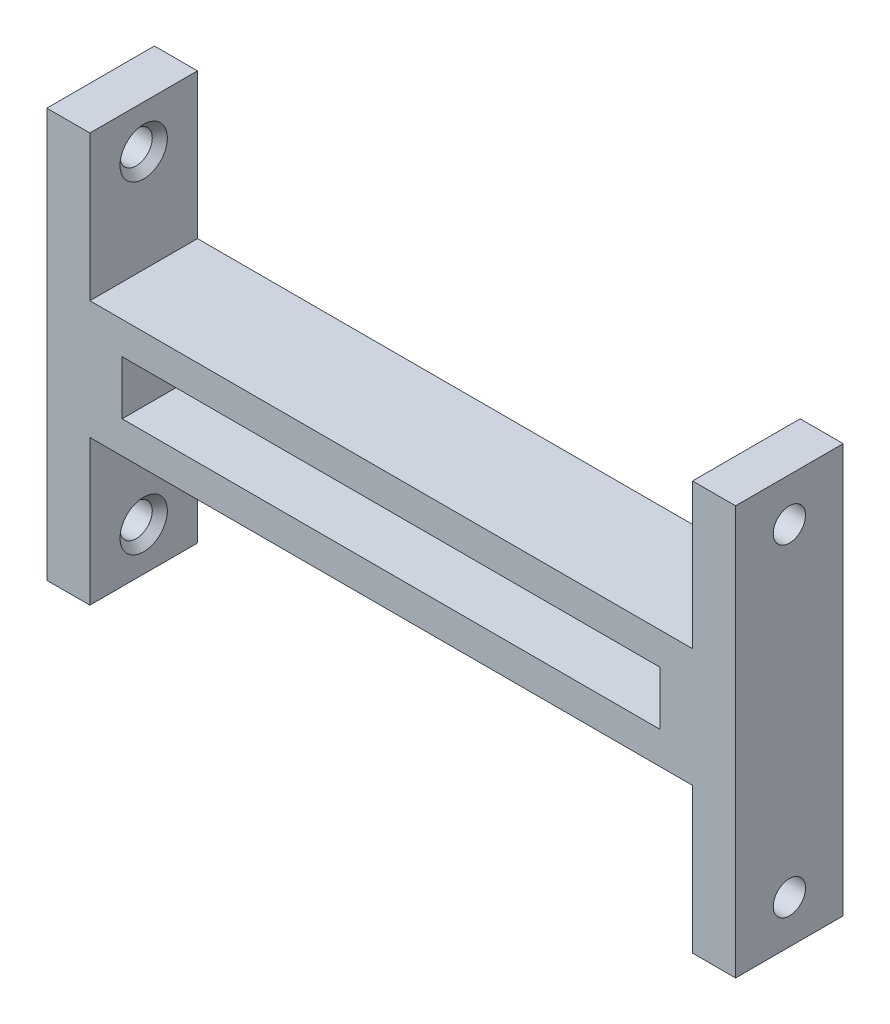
ISO-10303-21;
HEADER;
FILE_DESCRIPTION(('STEP AP214'),'2;1');
FILE_NAME('part.step','',(''),(''),'','','');
FILE_SCHEMA(('AUTOMOTIVE_DESIGN { 1 0 10303 214 1 1 1 1 }'));
ENDSEC;
DATA;
#1=APPLICATION_CONTEXT('core data for automotive mechanical design processes');
#2=APPLICATION_PROTOCOL_DEFINITION('international standard','automotive_design',2000,#1);
#3=PRODUCT_CONTEXT('',#1,'mechanical');
#4=PRODUCT('Part','Part','',(#3));
#5=PRODUCT_RELATED_PRODUCT_CATEGORY('part','',(#4));
#6=PRODUCT_DEFINITION_FORMATION('','',#4);
#7=PRODUCT_DEFINITION_CONTEXT('part definition',#1,'design');
#8=PRODUCT_DEFINITION('design','',#6,#7);
#9=PRODUCT_DEFINITION_SHAPE('','',#8);
#10=(LENGTH_UNIT() NAMED_UNIT(*) SI_UNIT(.MILLI.,.METRE.));
#11=(NAMED_UNIT(*) PLANE_ANGLE_UNIT() SI_UNIT($,.RADIAN.));
#12=(NAMED_UNIT(*) SI_UNIT($,.STERADIAN.) SOLID_ANGLE_UNIT());
#13=UNCERTAINTY_MEASURE_WITH_UNIT(LENGTH_MEASURE(1.E-05),#10,'distance_accuracy_value','');
#14=(GEOMETRIC_REPRESENTATION_CONTEXT(3) GLOBAL_UNCERTAINTY_ASSIGNED_CONTEXT((#13)) GLOBAL_UNIT_ASSIGNED_CONTEXT((#10,
#11,#12)) REPRESENTATION_CONTEXT('',''));
#15=CARTESIAN_POINT('',(0.,0.,0.));
#16=DIRECTION('',(0.,0.,1.));
#17=DIRECTION('',(1.,0.,0.));
#18=AXIS2_PLACEMENT_3D('',#15,#16,#17);
#19=CARTESIAN_POINT('',(-4.83020528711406,40.2956916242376,10.));
#20=DIRECTION('',(-1.,0.,0.));
#21=DIRECTION('',(0.,0.,1.));
#22=AXIS2_PLACEMENT_3D('',#19,#20,#21);
#23=PLANE('',#22);
#24=DIRECTION('',(0.,1.,0.));
#25=VECTOR('',#24,1.);
#26=CARTESIAN_POINT('',(-4.83020528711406,40.2956916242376,0.));
#27=LINE('',#26,#25);
#28=CARTESIAN_POINT('',(-4.83020528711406,40.2956916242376,0.));
#29=VERTEX_POINT('',#28);
#30=CARTESIAN_POINT('',(-4.83020528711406,53.7956916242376,0.));
#31=VERTEX_POINT('',#30);
#32=EDGE_CURVE('E266',#29,#31,#27,.T.);
#33=ORIENTED_EDGE('',*,*,#32,.T.);
#34=DIRECTION('',(0.,0.,-1.));
#35=VECTOR('',#34,1.);
#36=CARTESIAN_POINT('',(-4.83020528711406,53.7956916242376,10.));
#37=LINE('',#36,#35);
#38=CARTESIAN_POINT('',(-4.83020528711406,53.7956916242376,10.));
#39=VERTEX_POINT('',#38);
#40=EDGE_CURVE('E309',#39,#31,#37,.T.);
#41=ORIENTED_EDGE('',*,*,#40,.F.);
#42=DIRECTION('',(0.,1.,0.));
#43=VECTOR('',#42,1.);
#44=CARTESIAN_POINT('',(-4.83020528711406,40.2956916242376,10.));
#45=LINE('',#44,#43);
#46=CARTESIAN_POINT('',(-4.83020528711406,40.2956916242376,10.));
#47=VERTEX_POINT('',#46);
#48=EDGE_CURVE('E229',#47,#39,#45,.T.);
#49=ORIENTED_EDGE('',*,*,#48,.F.);
#50=DIRECTION('',(0.,0.,-1.));
#51=VECTOR('',#50,1.);
#52=CARTESIAN_POINT('',(-4.83020528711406,40.2956916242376,10.));
#53=LINE('',#52,#51);
#54=EDGE_CURVE('E313',#47,#29,#53,.T.);
#55=ORIENTED_EDGE('',*,*,#54,.T.);
#56=EDGE_LOOP('',(#33,#41,#49,#55));
#57=FACE_BOUND('',#56,.T.);
#58=CARTESIAN_POINT('',(-4.83020528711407,49.7956916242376,5.));
#59=DIRECTION('',(1.,0.,0.));
#60=DIRECTION('',(0.,0.,-1.));
#61=AXIS2_PLACEMENT_3D('',#58,#59,#60);
#62=CIRCLE('',#61,2.2);
#63=CARTESIAN_POINT('',(-4.83020528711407,49.7956916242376,2.8));
#64=VERTEX_POINT('',#63);
#65=EDGE_CURVE('E445',#64,#64,#62,.T.);
#66=ORIENTED_EDGE('',*,*,#65,.F.);
#67=EDGE_LOOP('',(#66));
#68=FACE_BOUND('',#67,.T.);
#69=ADVANCED_FACE('F45',(#57,#68),#23,.F.);
#70=CARTESIAN_POINT('',(51.1697947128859,40.2956916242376,10.));
#71=DIRECTION('',(1.,0.,0.));
#72=DIRECTION('',(0.,1.,0.));
#73=AXIS2_PLACEMENT_3D('',#70,#71,#72);
#74=PLANE('',#73);
#75=DIRECTION('',(0.,-1.,0.));
#76=VECTOR('',#75,1.);
#77=CARTESIAN_POINT('',(51.1697947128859,40.2956916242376,0.));
#78=LINE('',#77,#76);
#79=CARTESIAN_POINT('',(51.169794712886,53.7956916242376,0.));
#80=VERTEX_POINT('',#79);
#81=CARTESIAN_POINT('',(51.1697947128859,40.2956916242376,0.));
#82=VERTEX_POINT('',#81);
#83=EDGE_CURVE('E260',#80,#82,#78,.T.);
#84=ORIENTED_EDGE('',*,*,#83,.T.);
#85=DIRECTION('',(0.,0.,-1.));
#86=VECTOR('',#85,1.);
#87=CARTESIAN_POINT('',(51.1697947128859,40.2956916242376,10.));
#88=LINE('',#87,#86);
#89=CARTESIAN_POINT('',(51.1697947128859,40.2956916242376,10.));
#90=VERTEX_POINT('',#89);
#91=EDGE_CURVE('E317',#90,#82,#88,.T.);
#92=ORIENTED_EDGE('',*,*,#91,.F.);
#93=DIRECTION('',(0.,-1.,0.));
#94=VECTOR('',#93,1.);
#95=CARTESIAN_POINT('',(51.1697947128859,40.2956916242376,10.));
#96=LINE('',#95,#94);
#97=CARTESIAN_POINT('',(51.169794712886,53.7956916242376,10.));
#98=VERTEX_POINT('',#97);
#99=EDGE_CURVE('E223',#98,#90,#96,.T.);
#100=ORIENTED_EDGE('',*,*,#99,.F.);
#101=DIRECTION('',(0.,0.,-1.));
#102=VECTOR('',#101,1.);
#103=CARTESIAN_POINT('',(51.169794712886,53.7956916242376,10.));
#104=LINE('',#103,#102);
#105=EDGE_CURVE('E321',#98,#80,#104,.T.);
#106=ORIENTED_EDGE('',*,*,#105,.T.);
#107=EDGE_LOOP('',(#84,#92,#100,#106));
#108=FACE_BOUND('',#107,.T.);
#109=CARTESIAN_POINT('',(51.169794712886,49.7956916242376,5.));
#110=DIRECTION('',(-1.,0.,0.));
#111=DIRECTION('',(0.,0.,1.));
#112=AXIS2_PLACEMENT_3D('',#109,#110,#111);
#113=CIRCLE('',#112,2.2);
#114=CARTESIAN_POINT('',(51.169794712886,49.7956916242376,7.2));
#115=VERTEX_POINT('',#114);
#116=EDGE_CURVE('E331',#115,#115,#113,.T.);
#117=ORIENTED_EDGE('',*,*,#116,.F.);
#118=EDGE_LOOP('',(#117));
#119=FACE_BOUND('',#118,.T.);
#120=ADVANCED_FACE('F389',(#108,#119),#74,.F.);
#121=CARTESIAN_POINT('',(0.,0.,10.));
#122=DIRECTION('',(0.,0.,-1.));
#123=DIRECTION('',(-1.,0.,0.));
#124=AXIS2_PLACEMENT_3D('',#121,#122,#123);
#125=PLANE('',#124);
#126=DIRECTION('',(1.,0.,0.));
#127=VECTOR('',#126,1.);
#128=CARTESIAN_POINT('',(55.1697947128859,15.7956916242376,10.));
#129=LINE('',#128,#127);
#130=CARTESIAN_POINT('',(51.169794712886,15.7956916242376,10.));
#131=VERTEX_POINT('',#130);
#132=CARTESIAN_POINT('',(55.1697947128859,15.7956916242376,10.));
#133=VERTEX_POINT('',#132);
#134=EDGE_CURVE('E212',#131,#133,#129,.T.);
#135=ORIENTED_EDGE('',*,*,#134,.T.);
#136=DIRECTION('',(0.,1.,0.));
#137=VECTOR('',#136,1.);
#138=CARTESIAN_POINT('',(55.1697947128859,53.7956916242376,10.));
#139=LINE('',#138,#137);
#140=CARTESIAN_POINT('',(55.1697947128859,53.7956916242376,10.));
#141=VERTEX_POINT('',#140);
#142=EDGE_CURVE('E216',#133,#141,#139,.T.);
#143=ORIENTED_EDGE('',*,*,#142,.T.);
#144=DIRECTION('',(-1.,0.,0.));
#145=VECTOR('',#144,1.);
#146=CARTESIAN_POINT('',(51.169794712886,53.7956916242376,10.));
#147=LINE('',#146,#145);
#148=EDGE_CURVE('E220',#141,#98,#147,.T.);
#149=ORIENTED_EDGE('',*,*,#148,.T.);
#150=ORIENTED_EDGE('',*,*,#99,.T.);
#151=DIRECTION('',(-1.,0.,0.));
#152=VECTOR('',#151,1.);
#153=CARTESIAN_POINT('',(-4.83020528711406,40.2956916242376,10.));
#154=LINE('',#153,#152);
#155=EDGE_CURVE('E226',#90,#47,#154,.T.);
#156=ORIENTED_EDGE('',*,*,#155,.T.);
#157=ORIENTED_EDGE('',*,*,#48,.T.);
#158=DIRECTION('',(-1.,0.,0.));
#159=VECTOR('',#158,1.);
#160=CARTESIAN_POINT('',(-4.83020528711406,53.7956916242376,10.));
#161=LINE('',#160,#159);
#162=CARTESIAN_POINT('',(-8.83020528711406,53.7956916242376,10.));
#163=VERTEX_POINT('',#162);
#164=EDGE_CURVE('E232',#39,#163,#161,.T.);
#165=ORIENTED_EDGE('',*,*,#164,.T.);
#166=DIRECTION('',(0.,-1.,0.));
#167=VECTOR('',#166,1.);
#168=CARTESIAN_POINT('',(-8.83020528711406,53.7956916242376,10.));
#169=LINE('',#168,#167);
#170=CARTESIAN_POINT('',(-8.83020528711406,15.7956916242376,10.));
#171=VERTEX_POINT('',#170);
#172=EDGE_CURVE('E235',#163,#171,#169,.T.);
#173=ORIENTED_EDGE('',*,*,#172,.T.);
#174=DIRECTION('',(1.,0.,0.));
#175=VECTOR('',#174,1.);
#176=CARTESIAN_POINT('',(-8.83020528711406,15.7956916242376,10.));
#177=LINE('',#176,#175);
#178=CARTESIAN_POINT('',(-4.83020528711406,15.7956916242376,10.));
#179=VERTEX_POINT('',#178);
#180=EDGE_CURVE('E238',#171,#179,#177,.T.);
#181=ORIENTED_EDGE('',*,*,#180,.T.);
#182=DIRECTION('',(0.,1.,0.));
#183=VECTOR('',#182,1.);
#184=CARTESIAN_POINT('',(-4.83020528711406,15.7956916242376,10.));
#185=LINE('',#184,#183);
#186=CARTESIAN_POINT('',(-4.83020528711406,29.2956916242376,10.));
#187=VERTEX_POINT('',#186);
#188=EDGE_CURVE('E241',#179,#187,#185,.T.);
#189=ORIENTED_EDGE('',*,*,#188,.T.);
#190=DIRECTION('',(1.,0.,0.));
#191=VECTOR('',#190,1.);
#192=CARTESIAN_POINT('',(-4.83020528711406,29.2956916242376,10.));
#193=LINE('',#192,#191);
#194=CARTESIAN_POINT('',(51.1697947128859,29.2956916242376,10.));
#195=VERTEX_POINT('',#194);
#196=EDGE_CURVE('E244',#187,#195,#193,.T.);
#197=ORIENTED_EDGE('',*,*,#196,.T.);
#198=DIRECTION('',(0.,-1.,0.));
#199=VECTOR('',#198,1.);
#200=CARTESIAN_POINT('',(51.169794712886,15.7956916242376,10.));
#201=LINE('',#200,#199);
#202=EDGE_CURVE('E247',#195,#131,#201,.T.);
#203=ORIENTED_EDGE('',*,*,#202,.T.);
#204=EDGE_LOOP('',(#135,#143,#149,#150,#156,#157,#165,#173,#181,#189,#197,#203));
#205=FACE_BOUND('',#204,.T.);
#206=DIRECTION('',(0.,-1.,0.));
#207=VECTOR('',#206,1.);
#208=CARTESIAN_POINT('',(-1.83020528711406,32.2956916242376,10.));
#209=LINE('',#208,#207);
#210=CARTESIAN_POINT('',(-1.83020528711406,37.2956916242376,10.));
#211=VERTEX_POINT('',#210);
#212=CARTESIAN_POINT('',(-1.83020528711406,32.2956916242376,10.));
#213=VERTEX_POINT('',#212);
#214=EDGE_CURVE('E161',#211,#213,#209,.T.);
#215=ORIENTED_EDGE('',*,*,#214,.F.);
#216=DIRECTION('',(-1.,0.,0.));
#217=VECTOR('',#216,1.);
#218=CARTESIAN_POINT('',(-1.83020528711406,37.2956916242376,10.));
#219=LINE('',#218,#217);
#220=CARTESIAN_POINT('',(48.1697947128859,37.2956916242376,10.));
#221=VERTEX_POINT('',#220);
#222=EDGE_CURVE('E188',#221,#211,#219,.T.);
#223=ORIENTED_EDGE('',*,*,#222,.F.);
#224=DIRECTION('',(0.,1.,0.));
#225=VECTOR('',#224,1.);
#226=CARTESIAN_POINT('',(48.1697947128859,37.2956916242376,10.));
#227=LINE('',#226,#225);
#228=CARTESIAN_POINT('',(48.1697947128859,32.2956916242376,10.));
#229=VERTEX_POINT('',#228);
#230=EDGE_CURVE('E184',#229,#221,#227,.T.);
#231=ORIENTED_EDGE('',*,*,#230,.F.);
#232=DIRECTION('',(1.,0.,0.));
#233=VECTOR('',#232,1.);
#234=CARTESIAN_POINT('',(-1.83020528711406,32.2956916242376,10.));
#235=LINE('',#234,#233);
#236=EDGE_CURVE('E170',#213,#229,#235,.T.);
#237=ORIENTED_EDGE('',*,*,#236,.F.);
#238=EDGE_LOOP('',(#215,#223,#231,#237));
#239=FACE_BOUND('',#238,.T.);
#240=ADVANCED_FACE('F183',(#205,#239),#125,.F.);
#241=CARTESIAN_POINT('',(0.,0.,0.));
#242=DIRECTION('',(0.,0.,-1.));
#243=DIRECTION('',(-1.,0.,0.));
#244=AXIS2_PLACEMENT_3D('',#241,#242,#243);
#245=PLANE('',#244);
#246=DIRECTION('',(1.,0.,0.));
#247=VECTOR('',#246,1.);
#248=CARTESIAN_POINT('',(55.1697947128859,15.7956916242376,0.));
#249=LINE('',#248,#247);
#250=CARTESIAN_POINT('',(51.169794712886,15.7956916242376,0.));
#251=VERTEX_POINT('',#250);
#252=CARTESIAN_POINT('',(55.1697947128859,15.7956916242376,0.));
#253=VERTEX_POINT('',#252);
#254=EDGE_CURVE('E179',#251,#253,#249,.T.);
#255=ORIENTED_EDGE('',*,*,#254,.F.);
#256=DIRECTION('',(0.,-1.,0.));
#257=VECTOR('',#256,1.);
#258=CARTESIAN_POINT('',(51.169794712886,15.7956916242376,0.));
#259=LINE('',#258,#257);
#260=CARTESIAN_POINT('',(51.1697947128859,29.2956916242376,0.));
#261=VERTEX_POINT('',#260);
#262=EDGE_CURVE('E217',#261,#251,#259,.T.);
#263=ORIENTED_EDGE('',*,*,#262,.F.);
#264=DIRECTION('',(1.,0.,0.));
#265=VECTOR('',#264,1.);
#266=CARTESIAN_POINT('',(-4.83020528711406,29.2956916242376,0.));
#267=LINE('',#266,#265);
#268=CARTESIAN_POINT('',(-4.83020528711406,29.2956916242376,0.));
#269=VERTEX_POINT('',#268);
#270=EDGE_CURVE('E281',#269,#261,#267,.T.);
#271=ORIENTED_EDGE('',*,*,#270,.F.);
#272=DIRECTION('',(0.,1.,0.));
#273=VECTOR('',#272,1.);
#274=CARTESIAN_POINT('',(-4.83020528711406,15.7956916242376,0.));
#275=LINE('',#274,#273);
#276=CARTESIAN_POINT('',(-4.83020528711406,15.7956916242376,0.));
#277=VERTEX_POINT('',#276);
#278=EDGE_CURVE('E278',#277,#269,#275,.T.);
#279=ORIENTED_EDGE('',*,*,#278,.F.);
#280=DIRECTION('',(1.,0.,0.));
#281=VECTOR('',#280,1.);
#282=CARTESIAN_POINT('',(-8.83020528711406,15.7956916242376,0.));
#283=LINE('',#282,#281);
#284=CARTESIAN_POINT('',(-8.83020528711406,15.7956916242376,0.));
#285=VERTEX_POINT('',#284);
#286=EDGE_CURVE('E275',#285,#277,#283,.T.);
#287=ORIENTED_EDGE('',*,*,#286,.F.);
#288=DIRECTION('',(0.,-1.,0.));
#289=VECTOR('',#288,1.);
#290=CARTESIAN_POINT('',(-8.83020528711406,53.7956916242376,0.));
#291=LINE('',#290,#289);
#292=CARTESIAN_POINT('',(-8.83020528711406,53.7956916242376,0.));
#293=VERTEX_POINT('',#292);
#294=EDGE_CURVE('E272',#293,#285,#291,.T.);
#295=ORIENTED_EDGE('',*,*,#294,.F.);
#296=DIRECTION('',(-1.,0.,0.));
#297=VECTOR('',#296,1.);
#298=CARTESIAN_POINT('',(-4.83020528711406,53.7956916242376,0.));
#299=LINE('',#298,#297);
#300=EDGE_CURVE('E269',#31,#293,#299,.T.);
#301=ORIENTED_EDGE('',*,*,#300,.F.);
#302=ORIENTED_EDGE('',*,*,#32,.F.);
#303=DIRECTION('',(-1.,0.,0.));
#304=VECTOR('',#303,1.);
#305=CARTESIAN_POINT('',(-4.83020528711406,40.2956916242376,0.));
#306=LINE('',#305,#304);
#307=EDGE_CURVE('E263',#82,#29,#306,.T.);
#308=ORIENTED_EDGE('',*,*,#307,.F.);
#309=ORIENTED_EDGE('',*,*,#83,.F.);
#310=DIRECTION('',(-1.,0.,0.));
#311=VECTOR('',#310,1.);
#312=CARTESIAN_POINT('',(51.169794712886,53.7956916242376,0.));
#313=LINE('',#312,#311);
#314=CARTESIAN_POINT('',(55.1697947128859,53.7956916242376,0.));
#315=VERTEX_POINT('',#314);
#316=EDGE_CURVE('E257',#315,#80,#313,.T.);
#317=ORIENTED_EDGE('',*,*,#316,.F.);
#318=DIRECTION('',(0.,1.,0.));
#319=VECTOR('',#318,1.);
#320=CARTESIAN_POINT('',(55.1697947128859,53.7956916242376,0.));
#321=LINE('',#320,#319);
#322=EDGE_CURVE('E254',#253,#315,#321,.T.);
#323=ORIENTED_EDGE('',*,*,#322,.F.);
#324=EDGE_LOOP('',(#255,#263,#271,#279,#287,#295,#301,#302,#308,#309,#317,#323));
#325=FACE_BOUND('',#324,.T.);
#326=DIRECTION('',(-1.,0.,0.));
#327=VECTOR('',#326,1.);
#328=CARTESIAN_POINT('',(-1.83020528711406,37.2956916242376,0.));
#329=LINE('',#328,#327);
#330=CARTESIAN_POINT('',(48.1697947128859,37.2956916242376,0.));
#331=VERTEX_POINT('',#330);
#332=CARTESIAN_POINT('',(-1.83020528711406,37.2956916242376,0.));
#333=VERTEX_POINT('',#332);
#334=EDGE_CURVE('E171',#331,#333,#329,.T.);
#335=ORIENTED_EDGE('',*,*,#334,.T.);
#336=DIRECTION('',(0.,-1.,0.));
#337=VECTOR('',#336,1.);
#338=CARTESIAN_POINT('',(-1.83020528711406,32.2956916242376,0.));
#339=LINE('',#338,#337);
#340=CARTESIAN_POINT('',(-1.83020528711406,32.2956916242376,0.));
#341=VERTEX_POINT('',#340);
#342=EDGE_CURVE('E71',#333,#341,#339,.T.);
#343=ORIENTED_EDGE('',*,*,#342,.T.);
#344=DIRECTION('',(1.,0.,0.));
#345=VECTOR('',#344,1.);
#346=CARTESIAN_POINT('',(-1.83020528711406,32.2956916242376,0.));
#347=LINE('',#346,#345);
#348=CARTESIAN_POINT('',(48.1697947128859,32.2956916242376,0.));
#349=VERTEX_POINT('',#348);
#350=EDGE_CURVE('E177',#341,#349,#347,.T.);
#351=ORIENTED_EDGE('',*,*,#350,.T.);
#352=DIRECTION('',(0.,1.,0.));
#353=VECTOR('',#352,1.);
#354=CARTESIAN_POINT('',(48.1697947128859,37.2956916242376,0.));
#355=LINE('',#354,#353);
#356=EDGE_CURVE('E199',#349,#331,#355,.T.);
#357=ORIENTED_EDGE('',*,*,#356,.T.);
#358=EDGE_LOOP('',(#335,#343,#351,#357));
#359=FACE_BOUND('',#358,.T.);
#360=ADVANCED_FACE('F417',(#325,#359),#245,.T.);
#361=CARTESIAN_POINT('',(55.1697947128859,15.7956916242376,10.));
#362=DIRECTION('',(0.,1.,0.));
#363=DIRECTION('',(0.,0.,1.));
#364=AXIS2_PLACEMENT_3D('',#361,#362,#363);
#365=PLANE('',#364);
#366=ORIENTED_EDGE('',*,*,#254,.T.);
#367=DIRECTION('',(0.,0.,-1.));
#368=VECTOR('',#367,1.);
#369=CARTESIAN_POINT('',(55.1697947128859,15.7956916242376,10.));
#370=LINE('',#369,#368);
#371=EDGE_CURVE('E11',#133,#253,#370,.T.);
#372=ORIENTED_EDGE('',*,*,#371,.F.);
#373=ORIENTED_EDGE('',*,*,#134,.F.);
#374=DIRECTION('',(0.,0.,-1.));
#375=VECTOR('',#374,1.);
#376=CARTESIAN_POINT('',(51.169794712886,15.7956916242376,10.));
#377=LINE('',#376,#375);
#378=EDGE_CURVE('E250',#131,#251,#377,.T.);
#379=ORIENTED_EDGE('',*,*,#378,.T.);
#380=EDGE_LOOP('',(#366,#372,#373,#379));
#381=FACE_BOUND('',#380,.T.);
#382=ADVANCED_FACE('F47',(#381),#365,.F.);
#383=CARTESIAN_POINT('',(55.1697947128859,53.7956916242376,10.));
#384=DIRECTION('',(-1.,0.,0.));
#385=DIRECTION('',(0.,0.,1.));
#386=AXIS2_PLACEMENT_3D('',#383,#384,#385);
#387=PLANE('',#386);
#388=CARTESIAN_POINT('',(55.1697947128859,49.7956916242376,5.));
#389=DIRECTION('',(-1.,0.,0.));
#390=DIRECTION('',(0.,0.,1.));
#391=AXIS2_PLACEMENT_3D('',#388,#389,#390);
#392=CIRCLE('',#391,1.5);
#393=CARTESIAN_POINT('',(55.1697947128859,49.7956916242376,6.5));
#394=VERTEX_POINT('',#393);
#395=EDGE_CURVE('E196',#394,#394,#392,.T.);
#396=ORIENTED_EDGE('',*,*,#395,.T.);
#397=EDGE_LOOP('',(#396));
#398=FACE_BOUND('',#397,.T.);
#399=CARTESIAN_POINT('',(55.1697947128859,19.7956916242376,5.));
#400=DIRECTION('',(-1.,0.,0.));
#401=DIRECTION('',(0.,0.,1.));
#402=AXIS2_PLACEMENT_3D('',#399,#400,#401);
#403=CIRCLE('',#402,1.5);
#404=CARTESIAN_POINT('',(55.1697947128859,19.7956916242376,6.5));
#405=VERTEX_POINT('',#404);
#406=EDGE_CURVE('E353',#405,#405,#403,.T.);
#407=ORIENTED_EDGE('',*,*,#406,.T.);
#408=EDGE_LOOP('',(#407));
#409=FACE_BOUND('',#408,.T.);
#410=ORIENTED_EDGE('',*,*,#322,.T.);
#411=DIRECTION('',(0.,0.,-1.));
#412=VECTOR('',#411,1.);
#413=CARTESIAN_POINT('',(55.1697947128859,53.7956916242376,10.));
#414=LINE('',#413,#412);
#415=EDGE_CURVE('E55',#141,#315,#414,.T.);
#416=ORIENTED_EDGE('',*,*,#415,.F.);
#417=ORIENTED_EDGE('',*,*,#142,.F.);
#418=ORIENTED_EDGE('',*,*,#371,.T.);
#419=EDGE_LOOP('',(#410,#416,#417,#418));
#420=FACE_BOUND('',#419,.T.);
#421=ADVANCED_FACE('F368',(#398,#409,#420),#387,.F.);
#422=CARTESIAN_POINT('',(51.169794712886,53.7956916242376,10.));
#423=DIRECTION('',(0.,-1.,0.));
#424=DIRECTION('',(1.,0.,0.));
#425=AXIS2_PLACEMENT_3D('',#422,#423,#424);
#426=PLANE('',#425);
#427=ORIENTED_EDGE('',*,*,#316,.T.);
#428=ORIENTED_EDGE('',*,*,#105,.F.);
#429=ORIENTED_EDGE('',*,*,#148,.F.);
#430=ORIENTED_EDGE('',*,*,#415,.T.);
#431=EDGE_LOOP('',(#427,#428,#429,#430));
#432=FACE_BOUND('',#431,.T.);
#433=ADVANCED_FACE('F406',(#432),#426,.F.);
#434=CARTESIAN_POINT('',(-4.83020528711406,40.2956916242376,10.));
#435=DIRECTION('',(0.,-1.,0.));
#436=DIRECTION('',(0.,0.,-1.));
#437=AXIS2_PLACEMENT_3D('',#434,#435,#436);
#438=PLANE('',#437);
#439=ORIENTED_EDGE('',*,*,#307,.T.);
#440=ORIENTED_EDGE('',*,*,#54,.F.);
#441=ORIENTED_EDGE('',*,*,#155,.F.);
#442=ORIENTED_EDGE('',*,*,#91,.T.);
#443=EDGE_LOOP('',(#439,#440,#441,#442));
#444=FACE_BOUND('',#443,.T.);
#445=ADVANCED_FACE('F404',(#444),#438,.F.);
#446=CARTESIAN_POINT('',(-4.83020528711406,53.7956916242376,10.));
#447=DIRECTION('',(0.,-1.,0.));
#448=DIRECTION('',(1.,0.,0.));
#449=AXIS2_PLACEMENT_3D('',#446,#447,#448);
#450=PLANE('',#449);
#451=ORIENTED_EDGE('',*,*,#300,.T.);
#452=DIRECTION('',(0.,0.,-1.));
#453=VECTOR('',#452,1.);
#454=CARTESIAN_POINT('',(-8.83020528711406,53.7956916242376,10.));
#455=LINE('',#454,#453);
#456=EDGE_CURVE('E305',#163,#293,#455,.T.);
#457=ORIENTED_EDGE('',*,*,#456,.F.);
#458=ORIENTED_EDGE('',*,*,#164,.F.);
#459=ORIENTED_EDGE('',*,*,#40,.T.);
#460=EDGE_LOOP('',(#451,#457,#458,#459));
#461=FACE_BOUND('',#460,.T.);
#462=ADVANCED_FACE('F402',(#461),#450,.F.);
#463=CARTESIAN_POINT('',(-8.83020528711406,53.7956916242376,10.));
#464=DIRECTION('',(1.,0.,0.));
#465=DIRECTION('',(0.,0.,-1.));
#466=AXIS2_PLACEMENT_3D('',#463,#464,#465);
#467=PLANE('',#466);
#468=CARTESIAN_POINT('',(-8.83020528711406,49.7956916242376,5.));
#469=DIRECTION('',(-1.,0.,0.));
#470=DIRECTION('',(0.,0.,1.));
#471=AXIS2_PLACEMENT_3D('',#468,#469,#470);
#472=CIRCLE('',#471,1.5);
#473=CARTESIAN_POINT('',(-8.83020528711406,49.7956916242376,6.5));
#474=VERTEX_POINT('',#473);
#475=EDGE_CURVE('E357',#474,#474,#472,.T.);
#476=ORIENTED_EDGE('',*,*,#475,.F.);
#477=EDGE_LOOP('',(#476));
#478=FACE_BOUND('',#477,.T.);
#479=CARTESIAN_POINT('',(-8.83020528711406,19.7956916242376,5.));
#480=DIRECTION('',(-1.,0.,0.));
#481=DIRECTION('',(0.,0.,1.));
#482=AXIS2_PLACEMENT_3D('',#479,#480,#481);
#483=CIRCLE('',#482,1.5);
#484=CARTESIAN_POINT('',(-8.83020528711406,19.7956916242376,6.5));
#485=VERTEX_POINT('',#484);
#486=EDGE_CURVE('E361',#485,#485,#483,.T.);
#487=ORIENTED_EDGE('',*,*,#486,.F.);
#488=EDGE_LOOP('',(#487));
#489=FACE_BOUND('',#488,.T.);
#490=ORIENTED_EDGE('',*,*,#294,.T.);
#491=DIRECTION('',(0.,0.,-1.));
#492=VECTOR('',#491,1.);
#493=CARTESIAN_POINT('',(-8.83020528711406,15.7956916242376,10.));
#494=LINE('',#493,#492);
#495=EDGE_CURVE('E301',#171,#285,#494,.T.);
#496=ORIENTED_EDGE('',*,*,#495,.F.);
#497=ORIENTED_EDGE('',*,*,#172,.F.);
#498=ORIENTED_EDGE('',*,*,#456,.T.);
#499=EDGE_LOOP('',(#490,#496,#497,#498));
#500=FACE_BOUND('',#499,.T.);
#501=ADVANCED_FACE('F490',(#478,#489,#500),#467,.F.);
#502=CARTESIAN_POINT('',(-8.83020528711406,15.7956916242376,10.));
#503=DIRECTION('',(0.,1.,0.));
#504=DIRECTION('',(0.,0.,1.));
#505=AXIS2_PLACEMENT_3D('',#502,#503,#504);
#506=PLANE('',#505);
#507=ORIENTED_EDGE('',*,*,#286,.T.);
#508=DIRECTION('',(0.,0.,-1.));
#509=VECTOR('',#508,1.);
#510=CARTESIAN_POINT('',(-4.83020528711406,15.7956916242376,10.));
#511=LINE('',#510,#509);
#512=EDGE_CURVE('E297',#179,#277,#511,.T.);
#513=ORIENTED_EDGE('',*,*,#512,.F.);
#514=ORIENTED_EDGE('',*,*,#180,.F.);
#515=ORIENTED_EDGE('',*,*,#495,.T.);
#516=EDGE_LOOP('',(#507,#513,#514,#515));
#517=FACE_BOUND('',#516,.T.);
#518=ADVANCED_FACE('F459',(#517),#506,.F.);
#519=CARTESIAN_POINT('',(-4.83020528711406,15.7956916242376,10.));
#520=DIRECTION('',(-1.,0.,0.));
#521=DIRECTION('',(0.,0.,1.));
#522=AXIS2_PLACEMENT_3D('',#519,#520,#521);
#523=PLANE('',#522);
#524=CARTESIAN_POINT('',(-4.83020528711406,19.7956916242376,5.));
#525=DIRECTION('',(1.,0.,0.));
#526=DIRECTION('',(0.,0.,-1.));
#527=AXIS2_PLACEMENT_3D('',#524,#525,#526);
#528=CIRCLE('',#527,2.2);
#529=CARTESIAN_POINT('',(-4.83020528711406,19.7956916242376,2.8));
#530=VERTEX_POINT('',#529);
#531=EDGE_CURVE('E346',#530,#530,#528,.T.);
#532=ORIENTED_EDGE('',*,*,#531,.F.);
#533=EDGE_LOOP('',(#532));
#534=FACE_BOUND('',#533,.T.);
#535=ORIENTED_EDGE('',*,*,#278,.T.);
#536=DIRECTION('',(0.,0.,-1.));
#537=VECTOR('',#536,1.);
#538=CARTESIAN_POINT('',(-4.83020528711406,29.2956916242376,10.));
#539=LINE('',#538,#537);
#540=EDGE_CURVE('E293',#187,#269,#539,.T.);
#541=ORIENTED_EDGE('',*,*,#540,.F.);
#542=ORIENTED_EDGE('',*,*,#188,.F.);
#543=ORIENTED_EDGE('',*,*,#512,.T.);
#544=EDGE_LOOP('',(#535,#541,#542,#543));
#545=FACE_BOUND('',#544,.T.);
#546=ADVANCED_FACE('F456',(#534,#545),#523,.F.);
#547=CARTESIAN_POINT('',(-4.83020528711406,29.2956916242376,10.));
#548=DIRECTION('',(0.,1.,0.));
#549=DIRECTION('',(0.,0.,1.));
#550=AXIS2_PLACEMENT_3D('',#547,#548,#549);
#551=PLANE('',#550);
#552=ORIENTED_EDGE('',*,*,#270,.T.);
#553=DIRECTION('',(0.,0.,-1.));
#554=VECTOR('',#553,1.);
#555=CARTESIAN_POINT('',(51.1697947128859,29.2956916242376,10.));
#556=LINE('',#555,#554);
#557=EDGE_CURVE('E289',#195,#261,#556,.T.);
#558=ORIENTED_EDGE('',*,*,#557,.F.);
#559=ORIENTED_EDGE('',*,*,#196,.F.);
#560=ORIENTED_EDGE('',*,*,#540,.T.);
#561=EDGE_LOOP('',(#552,#558,#559,#560));
#562=FACE_BOUND('',#561,.T.);
#563=ADVANCED_FACE('F458',(#562),#551,.F.);
#564=CARTESIAN_POINT('',(51.169794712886,15.7956916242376,10.));
#565=DIRECTION('',(1.,0.,0.));
#566=DIRECTION('',(0.,1.,0.));
#567=AXIS2_PLACEMENT_3D('',#564,#565,#566);
#568=PLANE('',#567);
#569=CARTESIAN_POINT('',(51.1697947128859,19.7956916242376,5.));
#570=DIRECTION('',(-1.,0.,0.));
#571=DIRECTION('',(0.,0.,1.));
#572=AXIS2_PLACEMENT_3D('',#569,#570,#571);
#573=CIRCLE('',#572,2.2);
#574=CARTESIAN_POINT('',(51.1697947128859,19.7956916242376,7.2));
#575=VERTEX_POINT('',#574);
#576=EDGE_CURVE('E330',#575,#575,#573,.T.);
#577=ORIENTED_EDGE('',*,*,#576,.F.);
#578=EDGE_LOOP('',(#577));
#579=FACE_BOUND('',#578,.T.);
#580=ORIENTED_EDGE('',*,*,#262,.T.);
#581=ORIENTED_EDGE('',*,*,#378,.F.);
#582=ORIENTED_EDGE('',*,*,#202,.F.);
#583=ORIENTED_EDGE('',*,*,#557,.T.);
#584=EDGE_LOOP('',(#580,#581,#582,#583));
#585=FACE_BOUND('',#584,.T.);
#586=ADVANCED_FACE('F476',(#579,#585),#568,.F.);
#587=CARTESIAN_POINT('',(-1.83020528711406,32.2956916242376,10.));
#588=DIRECTION('',(1.,0.,0.));
#589=DIRECTION('',(0.,1.,0.));
#590=AXIS2_PLACEMENT_3D('',#587,#588,#589);
#591=PLANE('',#590);
#592=ORIENTED_EDGE('',*,*,#342,.F.);
#593=DIRECTION('',(0.,0.,-1.));
#594=VECTOR('',#593,1.);
#595=CARTESIAN_POINT('',(-1.83020528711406,37.2956916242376,10.));
#596=LINE('',#595,#594);
#597=EDGE_CURVE('E165',#211,#333,#596,.T.);
#598=ORIENTED_EDGE('',*,*,#597,.F.);
#599=ORIENTED_EDGE('',*,*,#214,.T.);
#600=DIRECTION('',(0.,0.,-1.));
#601=VECTOR('',#600,1.);
#602=CARTESIAN_POINT('',(-1.83020528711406,32.2956916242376,10.));
#603=LINE('',#602,#601);
#604=EDGE_CURVE('E164',#213,#341,#603,.T.);
#605=ORIENTED_EDGE('',*,*,#604,.T.);
#606=EDGE_LOOP('',(#592,#598,#599,#605));
#607=FACE_BOUND('',#606,.T.);
#608=ADVANCED_FACE('F163',(#607),#591,.T.);
#609=CARTESIAN_POINT('',(-1.83020528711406,32.2956916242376,10.));
#610=DIRECTION('',(0.,1.,0.));
#611=DIRECTION('',(0.,0.,1.));
#612=AXIS2_PLACEMENT_3D('',#609,#610,#611);
#613=PLANE('',#612);
#614=ORIENTED_EDGE('',*,*,#350,.F.);
#615=ORIENTED_EDGE('',*,*,#604,.F.);
#616=ORIENTED_EDGE('',*,*,#236,.T.);
#617=DIRECTION('',(0.,0.,-1.));
#618=VECTOR('',#617,1.);
#619=CARTESIAN_POINT('',(48.1697947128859,32.2956916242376,10.));
#620=LINE('',#619,#618);
#621=EDGE_CURVE('E180',#229,#349,#620,.T.);
#622=ORIENTED_EDGE('',*,*,#621,.T.);
#623=EDGE_LOOP('',(#614,#615,#616,#622));
#624=FACE_BOUND('',#623,.T.);
#625=ADVANCED_FACE('F174',(#624),#613,.T.);
#626=CARTESIAN_POINT('',(48.1697947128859,37.2956916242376,10.));
#627=DIRECTION('',(-1.,0.,0.));
#628=DIRECTION('',(0.,0.,1.));
#629=AXIS2_PLACEMENT_3D('',#626,#627,#628);
#630=PLANE('',#629);
#631=ORIENTED_EDGE('',*,*,#356,.F.);
#632=ORIENTED_EDGE('',*,*,#621,.F.);
#633=ORIENTED_EDGE('',*,*,#230,.T.);
#634=DIRECTION('',(0.,0.,-1.));
#635=VECTOR('',#634,1.);
#636=CARTESIAN_POINT('',(48.1697947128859,37.2956916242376,10.));
#637=LINE('',#636,#635);
#638=EDGE_CURVE('E63',#221,#331,#637,.T.);
#639=ORIENTED_EDGE('',*,*,#638,.T.);
#640=EDGE_LOOP('',(#631,#632,#633,#639));
#641=FACE_BOUND('',#640,.T.);
#642=ADVANCED_FACE('F385',(#641),#630,.T.);
#643=CARTESIAN_POINT('',(-1.83020528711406,37.2956916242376,10.));
#644=DIRECTION('',(0.,-1.,0.));
#645=DIRECTION('',(0.,0.,-1.));
#646=AXIS2_PLACEMENT_3D('',#643,#644,#645);
#647=PLANE('',#646);
#648=ORIENTED_EDGE('',*,*,#334,.F.);
#649=ORIENTED_EDGE('',*,*,#638,.F.);
#650=ORIENTED_EDGE('',*,*,#222,.T.);
#651=ORIENTED_EDGE('',*,*,#597,.T.);
#652=EDGE_LOOP('',(#648,#649,#650,#651));
#653=FACE_BOUND('',#652,.T.);
#654=ADVANCED_FACE('F374',(#653),#647,.T.);
#655=CARTESIAN_POINT('',(55.1697947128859,19.7956916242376,5.));
#656=DIRECTION('',(-1.,0.,0.));
#657=DIRECTION('',(0.,0.,1.));
#658=AXIS2_PLACEMENT_3D('',#655,#656,#657);
#659=CYLINDRICAL_SURFACE('',#658,1.5);
#660=CARTESIAN_POINT('',(51.8697947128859,19.7956916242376,5.));
#661=DIRECTION('',(-1.,0.,0.));
#662=DIRECTION('',(0.,0.,1.));
#663=AXIS2_PLACEMENT_3D('',#660,#661,#662);
#664=CIRCLE('',#663,1.5);
#665=CARTESIAN_POINT('',(51.8697947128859,19.7956916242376,6.5));
#666=VERTEX_POINT('',#665);
#667=EDGE_CURVE('E337',#666,#666,#664,.T.);
#668=ORIENTED_EDGE('',*,*,#667,.T.);
#669=EDGE_LOOP('',(#668));
#670=FACE_BOUND('',#669,.T.);
#671=ORIENTED_EDGE('',*,*,#406,.F.);
#672=EDGE_LOOP('',(#671));
#673=FACE_BOUND('',#672,.T.);
#674=ADVANCED_FACE('F371',(#670,#673),#659,.F.);
#675=CARTESIAN_POINT('',(-5.53020528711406,19.7956916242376,5.));
#676=DIRECTION('',(1.,0.,0.));
#677=DIRECTION('',(0.,0.,-1.));
#678=AXIS2_PLACEMENT_3D('',#675,#676,#677);
#679=CIRCLE('',#678,1.5);
#680=CARTESIAN_POINT('',(-5.53020528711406,19.7956916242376,3.5));
#681=VERTEX_POINT('',#680);
#682=EDGE_CURVE('E340',#681,#681,#679,.T.);
#683=ORIENTED_EDGE('',*,*,#682,.T.);
#684=EDGE_LOOP('',(#683));
#685=FACE_BOUND('',#684,.T.);
#686=ORIENTED_EDGE('',*,*,#486,.T.);
#687=EDGE_LOOP('',(#686));
#688=FACE_BOUND('',#687,.T.);
#689=ADVANCED_FACE('F373',(#685,#688),#659,.F.);
#690=CARTESIAN_POINT('',(55.1697947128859,49.7956916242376,5.));
#691=DIRECTION('',(-1.,0.,0.));
#692=DIRECTION('',(0.,0.,1.));
#693=AXIS2_PLACEMENT_3D('',#690,#691,#692);
#694=CYLINDRICAL_SURFACE('',#693,1.5);
#695=CARTESIAN_POINT('',(-5.53020528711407,49.7956916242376,5.));
#696=DIRECTION('',(1.,0.,0.));
#697=DIRECTION('',(0.,0.,-1.));
#698=AXIS2_PLACEMENT_3D('',#695,#696,#697);
#699=CIRCLE('',#698,1.5);
#700=CARTESIAN_POINT('',(-5.53020528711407,49.7956916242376,3.5));
#701=VERTEX_POINT('',#700);
#702=EDGE_CURVE('E49',#701,#701,#699,.T.);
#703=ORIENTED_EDGE('',*,*,#702,.T.);
#704=EDGE_LOOP('',(#703));
#705=FACE_BOUND('',#704,.T.);
#706=ORIENTED_EDGE('',*,*,#475,.T.);
#707=EDGE_LOOP('',(#706));
#708=FACE_BOUND('',#707,.T.);
#709=ADVANCED_FACE('F382',(#705,#708),#694,.F.);
#710=CARTESIAN_POINT('',(51.8697947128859,49.7956916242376,5.));
#711=DIRECTION('',(-1.,0.,0.));
#712=DIRECTION('',(0.,0.,1.));
#713=AXIS2_PLACEMENT_3D('',#710,#711,#712);
#714=CIRCLE('',#713,1.5);
#715=CARTESIAN_POINT('',(51.8697947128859,49.7956916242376,6.5));
#716=VERTEX_POINT('',#715);
#717=EDGE_CURVE('E327',#716,#716,#714,.T.);
#718=ORIENTED_EDGE('',*,*,#717,.T.);
#719=EDGE_LOOP('',(#718));
#720=FACE_BOUND('',#719,.T.);
#721=ORIENTED_EDGE('',*,*,#395,.F.);
#722=EDGE_LOOP('',(#721));
#723=FACE_BOUND('',#722,.T.);
#724=ADVANCED_FACE('F421',(#720,#723),#694,.F.);
#725=CARTESIAN_POINT('',(51.1697947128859,19.7956916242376,5.));
#726=DIRECTION('',(-1.,0.,0.));
#727=DIRECTION('',(0.,0.,1.));
#728=AXIS2_PLACEMENT_3D('',#725,#726,#727);
#729=CONICAL_SURFACE('',#728,2.2,0.785398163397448);
#730=ORIENTED_EDGE('',*,*,#576,.T.);
#731=EDGE_LOOP('',(#730));
#732=FACE_BOUND('',#731,.T.);
#733=ORIENTED_EDGE('',*,*,#667,.F.);
#734=EDGE_LOOP('',(#733));
#735=FACE_BOUND('',#734,.T.);
#736=ADVANCED_FACE('F422',(#732,#735),#729,.F.);
#737=CARTESIAN_POINT('',(51.169794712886,49.7956916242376,5.));
#738=DIRECTION('',(-1.,0.,0.));
#739=DIRECTION('',(0.,0.,1.));
#740=AXIS2_PLACEMENT_3D('',#737,#738,#739);
#741=CONICAL_SURFACE('',#740,2.2,0.785398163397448);
#742=ORIENTED_EDGE('',*,*,#116,.T.);
#743=EDGE_LOOP('',(#742));
#744=FACE_BOUND('',#743,.T.);
#745=ORIENTED_EDGE('',*,*,#717,.F.);
#746=EDGE_LOOP('',(#745));
#747=FACE_BOUND('',#746,.T.);
#748=ADVANCED_FACE('F426',(#744,#747),#741,.F.);
#749=CARTESIAN_POINT('',(-4.83020528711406,19.7956916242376,5.));
#750=DIRECTION('',(1.,0.,0.));
#751=DIRECTION('',(0.,0.,-1.));
#752=AXIS2_PLACEMENT_3D('',#749,#750,#751);
#753=CONICAL_SURFACE('',#752,2.2,0.785398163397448);
#754=ORIENTED_EDGE('',*,*,#531,.T.);
#755=EDGE_LOOP('',(#754));
#756=FACE_BOUND('',#755,.T.);
#757=ORIENTED_EDGE('',*,*,#682,.F.);
#758=EDGE_LOOP('',(#757));
#759=FACE_BOUND('',#758,.T.);
#760=ADVANCED_FACE('F433',(#756,#759),#753,.F.);
#761=CARTESIAN_POINT('',(-4.83020528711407,49.7956916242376,5.));
#762=DIRECTION('',(1.,0.,0.));
#763=DIRECTION('',(0.,0.,-1.));
#764=AXIS2_PLACEMENT_3D('',#761,#762,#763);
#765=CONICAL_SURFACE('',#764,2.2,0.785398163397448);
#766=ORIENTED_EDGE('',*,*,#65,.T.);
#767=EDGE_LOOP('',(#766));
#768=FACE_BOUND('',#767,.T.);
#769=ORIENTED_EDGE('',*,*,#702,.F.);
#770=EDGE_LOOP('',(#769));
#771=FACE_BOUND('',#770,.T.);
#772=ADVANCED_FACE('F436',(#768,#771),#765,.F.);
#773=CLOSED_SHELL('',(#69,#120,#240,#360,#382,#421,#433,#445,#462,#501,#518,#546,#563,#586,#608,
#625,#642,#654,#674,#689,#709,#724,#736,#748,#760,#772));
#774=MANIFOLD_SOLID_BREP('B2',#773);
#775=ADVANCED_BREP_SHAPE_REPRESENTATION('',(#18,#774),#14);
#776=SHAPE_DEFINITION_REPRESENTATION(#9,#775);
ENDSEC;
END-ISO-10303-21;
